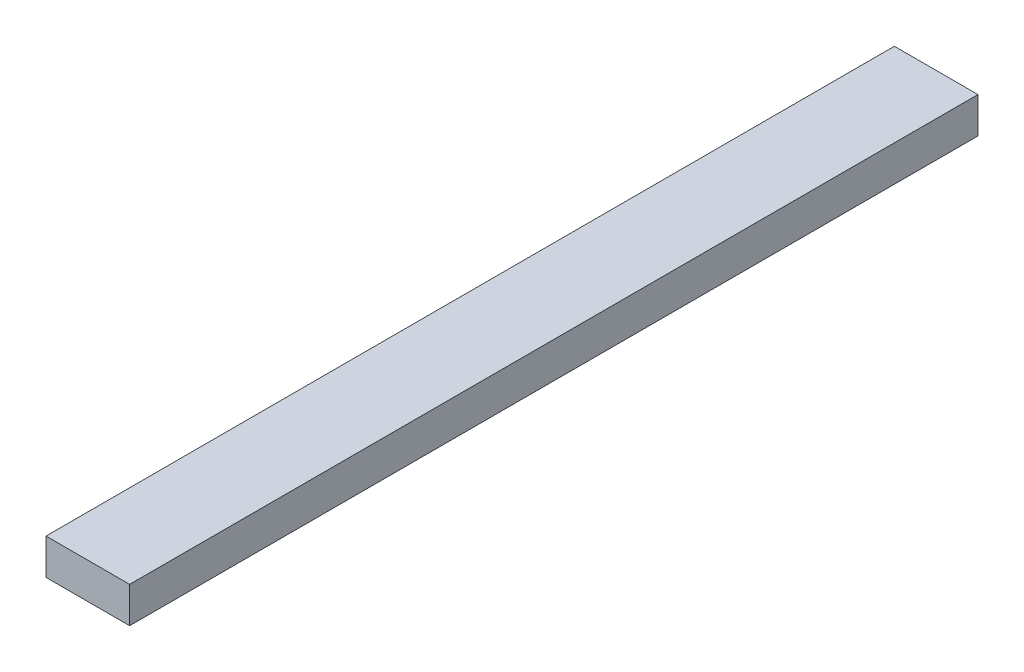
from build123d import *

# Parameters (mm, degrees)
SKETCH1_W           = 88.9
SKETCH1_H           = 901.7
BOSS_EXTRUDE1_DEPTH = 38.1


with BuildPart() as part:
    # Sketch1 → Boss-Extrude1 (new body)
    with BuildSketch(Plane(origin=(0, 0, 0), x_dir=(1, 0, 0), z_dir=(0, 1, 0))):
        with Locations((-44.45, -450.85)):
            Rectangle(SKETCH1_W, SKETCH1_H)
    extrude(amount=BOSS_EXTRUDE1_DEPTH)


solid = part.part
